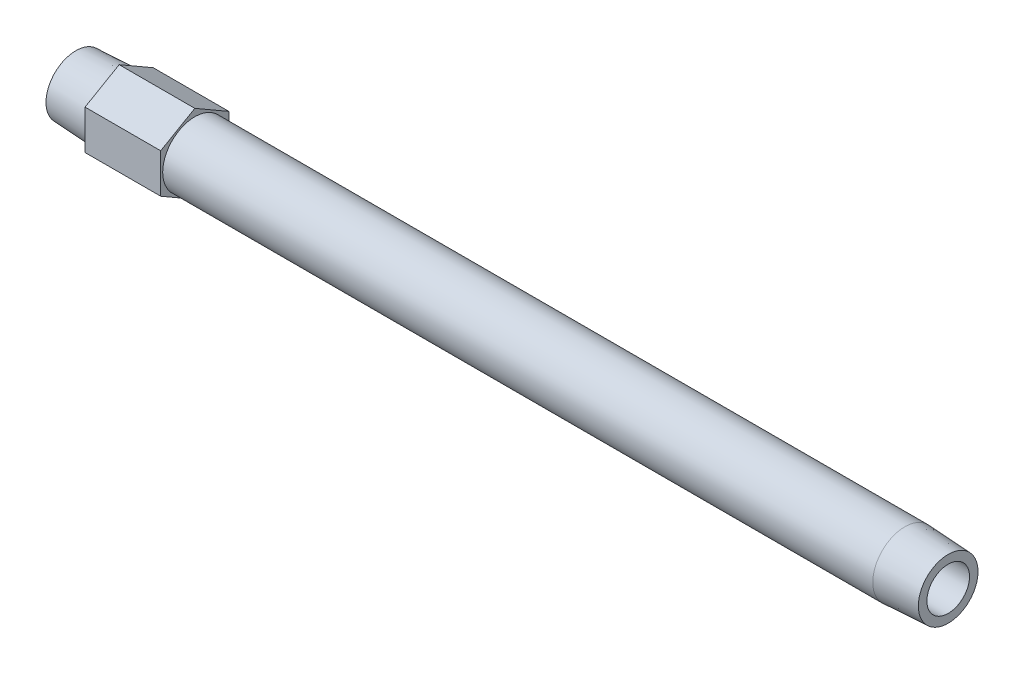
ISO-10303-21;
HEADER;
FILE_DESCRIPTION(('STEP AP214'),'2;1');
FILE_NAME('part.step','',(''),(''),'','','');
FILE_SCHEMA(('AUTOMOTIVE_DESIGN { 1 0 10303 214 1 1 1 1 }'));
ENDSEC;
DATA;
#1=APPLICATION_CONTEXT('core data for automotive mechanical design processes');
#2=APPLICATION_PROTOCOL_DEFINITION('international standard','automotive_design',2000,#1);
#3=PRODUCT_CONTEXT('',#1,'mechanical');
#4=PRODUCT('Part','Part','',(#3));
#5=PRODUCT_RELATED_PRODUCT_CATEGORY('part','',(#4));
#6=PRODUCT_DEFINITION_FORMATION('','',#4);
#7=PRODUCT_DEFINITION_CONTEXT('part definition',#1,'design');
#8=PRODUCT_DEFINITION('design','',#6,#7);
#9=PRODUCT_DEFINITION_SHAPE('','',#8);
#10=(LENGTH_UNIT() NAMED_UNIT(*) SI_UNIT(.MILLI.,.METRE.));
#11=(NAMED_UNIT(*) PLANE_ANGLE_UNIT() SI_UNIT($,.RADIAN.));
#12=(NAMED_UNIT(*) SI_UNIT($,.STERADIAN.) SOLID_ANGLE_UNIT());
#13=UNCERTAINTY_MEASURE_WITH_UNIT(LENGTH_MEASURE(1.E-05),#10,'distance_accuracy_value','');
#14=(GEOMETRIC_REPRESENTATION_CONTEXT(3) GLOBAL_UNCERTAINTY_ASSIGNED_CONTEXT((#13)) GLOBAL_UNIT_ASSIGNED_CONTEXT((#10,
#11,#12)) REPRESENTATION_CONTEXT('',''));
#15=CARTESIAN_POINT('',(0.,0.,0.));
#16=DIRECTION('',(0.,0.,1.));
#17=DIRECTION('',(1.,0.,0.));
#18=AXIS2_PLACEMENT_3D('',#15,#16,#17);
#19=CARTESIAN_POINT('',(0.,0.,-4.78009397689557));
#20=DIRECTION('',(1.,0.,0.));
#21=DIRECTION('',(0.,0.,-1.));
#22=AXIS2_PLACEMENT_3D('',#19,#20,#21);
#23=PLANE('',#22);
#24=CARTESIAN_POINT('',(0.,0.,0.));
#25=DIRECTION('',(-1.,0.,0.));
#26=DIRECTION('',(0.,0.,1.));
#27=AXIS2_PLACEMENT_3D('',#24,#25,#26);
#28=CIRCLE('',#27,4.78009397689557);
#29=CARTESIAN_POINT('',(0.,0.,4.78009397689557));
#30=VERTEX_POINT('',#29);
#31=EDGE_CURVE('E147',#30,#30,#28,.T.);
#32=ORIENTED_EDGE('',*,*,#31,.T.);
#33=EDGE_LOOP('',(#32));
#34=FACE_BOUND('',#33,.T.);
#35=CARTESIAN_POINT('',(0.,0.,0.));
#36=DIRECTION('',(1.,0.,0.));
#37=DIRECTION('',(0.,0.,1.));
#38=AXIS2_PLACEMENT_3D('',#35,#36,#37);
#39=CIRCLE('',#38,3.4163);
#40=CARTESIAN_POINT('',(0.,0.,3.4163));
#41=VERTEX_POINT('',#40);
#42=EDGE_CURVE('E159',#41,#41,#39,.T.);
#43=ORIENTED_EDGE('',*,*,#42,.T.);
#44=EDGE_LOOP('',(#43));
#45=FACE_BOUND('',#44,.T.);
#46=ADVANCED_FACE('F15',(#34,#45),#23,.F.);
#47=CARTESIAN_POINT('',(139.7,0.,-4.78009397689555));
#48=DIRECTION('',(-1.,0.,0.));
#49=DIRECTION('',(0.,0.,1.));
#50=AXIS2_PLACEMENT_3D('',#47,#48,#49);
#51=PLANE('',#50);
#52=CARTESIAN_POINT('',(139.7,0.,0.));
#53=DIRECTION('',(-1.,0.,0.));
#54=DIRECTION('',(0.,0.,1.));
#55=AXIS2_PLACEMENT_3D('',#52,#53,#54);
#56=CIRCLE('',#55,4.78009397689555);
#57=CARTESIAN_POINT('',(139.7,0.,4.78009397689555));
#58=VERTEX_POINT('',#57);
#59=EDGE_CURVE('E150',#58,#58,#56,.T.);
#60=ORIENTED_EDGE('',*,*,#59,.F.);
#61=EDGE_LOOP('',(#60));
#62=FACE_BOUND('',#61,.T.);
#63=CARTESIAN_POINT('',(139.7,0.,0.));
#64=DIRECTION('',(-1.,0.,0.));
#65=DIRECTION('',(0.,0.,1.));
#66=AXIS2_PLACEMENT_3D('',#63,#64,#65);
#67=CIRCLE('',#66,3.4163);
#68=CARTESIAN_POINT('',(139.7,0.,3.4163));
#69=VERTEX_POINT('',#68);
#70=EDGE_CURVE('E156',#69,#69,#67,.F.);
#71=ORIENTED_EDGE('',*,*,#70,.F.);
#72=EDGE_LOOP('',(#71));
#73=FACE_BOUND('',#72,.T.);
#74=ADVANCED_FACE('F178',(#62,#73),#51,.F.);
#75=CARTESIAN_POINT('',(19.05,-9.45872946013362,5.461));
#76=DIRECTION('',(-1.,0.,0.));
#77=DIRECTION('',(0.,-1.,0.));
#78=AXIS2_PLACEMENT_3D('',#75,#76,#77);
#79=PLANE('',#78);
#80=DIRECTION('',(0.,0.5,-0.866025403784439));
#81=VECTOR('',#80,1.);
#82=CARTESIAN_POINT('',(19.05,-6.30581964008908,0.));
#83=LINE('',#82,#81);
#84=CARTESIAN_POINT('',(19.05,-6.30581964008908,0.));
#85=VERTEX_POINT('',#84);
#86=CARTESIAN_POINT('',(19.05,-3.15290982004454,-5.461));
#87=VERTEX_POINT('',#86);
#88=EDGE_CURVE('E103',#85,#87,#83,.T.);
#89=ORIENTED_EDGE('',*,*,#88,.T.);
#90=DIRECTION('',(0.,1.,0.));
#91=VECTOR('',#90,1.);
#92=CARTESIAN_POINT('',(19.05,-3.15290982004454,-5.461));
#93=LINE('',#92,#91);
#94=CARTESIAN_POINT('',(19.05,3.15290982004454,-5.461));
#95=VERTEX_POINT('',#94);
#96=EDGE_CURVE('E83',#87,#95,#93,.T.);
#97=ORIENTED_EDGE('',*,*,#96,.T.);
#98=DIRECTION('',(0.,0.5,0.866025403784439));
#99=VECTOR('',#98,1.);
#100=CARTESIAN_POINT('',(19.05,3.15290982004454,-5.461));
#101=LINE('',#100,#99);
#102=CARTESIAN_POINT('',(19.05,6.30581964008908,0.));
#103=VERTEX_POINT('',#102);
#104=EDGE_CURVE('E102',#95,#103,#101,.T.);
#105=ORIENTED_EDGE('',*,*,#104,.T.);
#106=DIRECTION('',(0.,-0.5,0.866025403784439));
#107=VECTOR('',#106,1.);
#108=CARTESIAN_POINT('',(19.05,6.30581964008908,0.));
#109=LINE('',#108,#107);
#110=CARTESIAN_POINT('',(19.05,3.15290982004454,5.461));
#111=VERTEX_POINT('',#110);
#112=EDGE_CURVE('E105',#103,#111,#109,.T.);
#113=ORIENTED_EDGE('',*,*,#112,.T.);
#114=DIRECTION('',(0.,-1.,0.));
#115=VECTOR('',#114,1.);
#116=CARTESIAN_POINT('',(19.05,3.15290982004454,5.461));
#117=LINE('',#116,#115);
#118=CARTESIAN_POINT('',(19.05,-3.15290982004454,5.461));
#119=VERTEX_POINT('',#118);
#120=EDGE_CURVE('E35',#111,#119,#117,.T.);
#121=ORIENTED_EDGE('',*,*,#120,.T.);
#122=DIRECTION('',(0.,-0.5,-0.866025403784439));
#123=VECTOR('',#122,1.);
#124=CARTESIAN_POINT('',(19.05,-3.15290982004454,5.461));
#125=LINE('',#124,#123);
#126=EDGE_CURVE('E30',#119,#85,#125,.T.);
#127=ORIENTED_EDGE('',*,*,#126,.T.);
#128=EDGE_LOOP('',(#89,#97,#105,#113,#121,#127));
#129=FACE_BOUND('',#128,.T.);
#130=CARTESIAN_POINT('',(19.05,0.,0.));
#131=DIRECTION('',(-1.,0.,0.));
#132=DIRECTION('',(0.,-1.,0.));
#133=AXIS2_PLACEMENT_3D('',#130,#131,#132);
#134=CIRCLE('',#133,5.1435);
#135=CARTESIAN_POINT('',(19.05,-5.1435,0.));
#136=VERTEX_POINT('',#135);
#137=EDGE_CURVE('E89',#136,#136,#134,.F.);
#138=ORIENTED_EDGE('',*,*,#137,.F.);
#139=EDGE_LOOP('',(#138));
#140=FACE_BOUND('',#139,.T.);
#141=ADVANCED_FACE('F124',(#129,#140),#79,.F.);
#142=CARTESIAN_POINT('',(6.9342,-9.45872946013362,5.461));
#143=DIRECTION('',(-1.,0.,0.));
#144=DIRECTION('',(0.,-1.,0.));
#145=AXIS2_PLACEMENT_3D('',#142,#143,#144);
#146=PLANE('',#145);
#147=DIRECTION('',(0.,0.5,-0.866025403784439));
#148=VECTOR('',#147,1.);
#149=CARTESIAN_POINT('',(6.9342,-6.30581964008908,0.));
#150=LINE('',#149,#148);
#151=CARTESIAN_POINT('',(6.9342,-6.30581964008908,0.));
#152=VERTEX_POINT('',#151);
#153=CARTESIAN_POINT('',(6.9342,-3.15290982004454,-5.461));
#154=VERTEX_POINT('',#153);
#155=EDGE_CURVE('E73',#152,#154,#150,.T.);
#156=ORIENTED_EDGE('',*,*,#155,.F.);
#157=DIRECTION('',(0.,-0.5,-0.866025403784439));
#158=VECTOR('',#157,1.);
#159=CARTESIAN_POINT('',(6.9342,-3.15290982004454,5.461));
#160=LINE('',#159,#158);
#161=CARTESIAN_POINT('',(6.9342,-3.15290982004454,5.461));
#162=VERTEX_POINT('',#161);
#163=EDGE_CURVE('E99',#162,#152,#160,.T.);
#164=ORIENTED_EDGE('',*,*,#163,.F.);
#165=DIRECTION('',(0.,-1.,0.));
#166=VECTOR('',#165,1.);
#167=CARTESIAN_POINT('',(6.9342,3.15290982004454,5.461));
#168=LINE('',#167,#166);
#169=CARTESIAN_POINT('',(6.9342,3.15290982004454,5.461));
#170=VERTEX_POINT('',#169);
#171=EDGE_CURVE('E133',#170,#162,#168,.T.);
#172=ORIENTED_EDGE('',*,*,#171,.F.);
#173=DIRECTION('',(0.,-0.5,0.866025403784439));
#174=VECTOR('',#173,1.);
#175=CARTESIAN_POINT('',(6.9342,6.30581964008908,0.));
#176=LINE('',#175,#174);
#177=CARTESIAN_POINT('',(6.9342,6.30581964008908,0.));
#178=VERTEX_POINT('',#177);
#179=EDGE_CURVE('E129',#178,#170,#176,.T.);
#180=ORIENTED_EDGE('',*,*,#179,.F.);
#181=DIRECTION('',(0.,0.5,0.866025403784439));
#182=VECTOR('',#181,1.);
#183=CARTESIAN_POINT('',(6.9342,3.15290982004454,-5.461));
#184=LINE('',#183,#182);
#185=CARTESIAN_POINT('',(6.9342,3.15290982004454,-5.461));
#186=VERTEX_POINT('',#185);
#187=EDGE_CURVE('E75',#186,#178,#184,.T.);
#188=ORIENTED_EDGE('',*,*,#187,.F.);
#189=DIRECTION('',(0.,1.,0.));
#190=VECTOR('',#189,1.);
#191=CARTESIAN_POINT('',(6.9342,-3.15290982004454,-5.461));
#192=LINE('',#191,#190);
#193=EDGE_CURVE('E68',#154,#186,#192,.T.);
#194=ORIENTED_EDGE('',*,*,#193,.F.);
#195=EDGE_LOOP('',(#156,#164,#172,#180,#188,#194));
#196=FACE_BOUND('',#195,.T.);
#197=CARTESIAN_POINT('',(6.9342,0.,0.));
#198=DIRECTION('',(-1.,0.,0.));
#199=DIRECTION('',(0.,0.,1.));
#200=AXIS2_PLACEMENT_3D('',#197,#198,#199);
#201=CIRCLE('',#200,5.1435);
#202=CARTESIAN_POINT('',(6.9342,0.,5.1435));
#203=VERTEX_POINT('',#202);
#204=EDGE_CURVE('E95',#203,#203,#201,.T.);
#205=ORIENTED_EDGE('',*,*,#204,.F.);
#206=EDGE_LOOP('',(#205));
#207=FACE_BOUND('',#206,.T.);
#208=ADVANCED_FACE('F69',(#196,#207),#146,.T.);
#209=CARTESIAN_POINT('',(19.05,-6.30581964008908,0.));
#210=DIRECTION('',(0.,0.866025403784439,0.5));
#211=DIRECTION('',(0.,-0.5,0.866025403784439));
#212=AXIS2_PLACEMENT_3D('',#209,#210,#211);
#213=PLANE('',#212);
#214=ORIENTED_EDGE('',*,*,#155,.T.);
#215=DIRECTION('',(-1.,0.,0.));
#216=VECTOR('',#215,1.);
#217=CARTESIAN_POINT('',(19.05,-3.15290982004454,-5.461));
#218=LINE('',#217,#216);
#219=EDGE_CURVE('E10',#87,#154,#218,.T.);
#220=ORIENTED_EDGE('',*,*,#219,.F.);
#221=ORIENTED_EDGE('',*,*,#88,.F.);
#222=DIRECTION('',(-1.,0.,0.));
#223=VECTOR('',#222,1.);
#224=CARTESIAN_POINT('',(19.05,-6.30581964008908,0.));
#225=LINE('',#224,#223);
#226=EDGE_CURVE('E87',#85,#152,#225,.T.);
#227=ORIENTED_EDGE('',*,*,#226,.T.);
#228=EDGE_LOOP('',(#214,#220,#221,#227));
#229=FACE_BOUND('',#228,.T.);
#230=ADVANCED_FACE('F17',(#229),#213,.F.);
#231=CARTESIAN_POINT('',(19.05,-3.15290982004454,-5.461));
#232=DIRECTION('',(0.,0.,1.));
#233=DIRECTION('',(0.,-1.,0.));
#234=AXIS2_PLACEMENT_3D('',#231,#232,#233);
#235=PLANE('',#234);
#236=ORIENTED_EDGE('',*,*,#193,.T.);
#237=DIRECTION('',(-1.,0.,0.));
#238=VECTOR('',#237,1.);
#239=CARTESIAN_POINT('',(19.05,3.15290982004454,-5.461));
#240=LINE('',#239,#238);
#241=EDGE_CURVE('E23',#95,#186,#240,.T.);
#242=ORIENTED_EDGE('',*,*,#241,.F.);
#243=ORIENTED_EDGE('',*,*,#96,.F.);
#244=ORIENTED_EDGE('',*,*,#219,.T.);
#245=EDGE_LOOP('',(#236,#242,#243,#244));
#246=FACE_BOUND('',#245,.T.);
#247=ADVANCED_FACE('F82',(#246),#235,.F.);
#248=CARTESIAN_POINT('',(19.05,3.15290982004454,-5.461));
#249=DIRECTION('',(0.,-0.866025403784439,0.5));
#250=DIRECTION('',(0.,-0.5,-0.866025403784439));
#251=AXIS2_PLACEMENT_3D('',#248,#249,#250);
#252=PLANE('',#251);
#253=ORIENTED_EDGE('',*,*,#187,.T.);
#254=DIRECTION('',(-1.,0.,0.));
#255=VECTOR('',#254,1.);
#256=CARTESIAN_POINT('',(19.05,6.30581964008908,0.));
#257=LINE('',#256,#255);
#258=EDGE_CURVE('E117',#103,#178,#257,.T.);
#259=ORIENTED_EDGE('',*,*,#258,.F.);
#260=ORIENTED_EDGE('',*,*,#104,.F.);
#261=ORIENTED_EDGE('',*,*,#241,.T.);
#262=EDGE_LOOP('',(#253,#259,#260,#261));
#263=FACE_BOUND('',#262,.T.);
#264=ADVANCED_FACE('F121',(#263),#252,.F.);
#265=CARTESIAN_POINT('',(19.05,6.30581964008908,0.));
#266=DIRECTION('',(0.,-0.866025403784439,-0.5));
#267=DIRECTION('',(0.,0.5,-0.866025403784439));
#268=AXIS2_PLACEMENT_3D('',#265,#266,#267);
#269=PLANE('',#268);
#270=ORIENTED_EDGE('',*,*,#179,.T.);
#271=DIRECTION('',(-1.,0.,0.));
#272=VECTOR('',#271,1.);
#273=CARTESIAN_POINT('',(19.05,3.15290982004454,5.461));
#274=LINE('',#273,#272);
#275=EDGE_CURVE('E114',#111,#170,#274,.T.);
#276=ORIENTED_EDGE('',*,*,#275,.F.);
#277=ORIENTED_EDGE('',*,*,#112,.F.);
#278=ORIENTED_EDGE('',*,*,#258,.T.);
#279=EDGE_LOOP('',(#270,#276,#277,#278));
#280=FACE_BOUND('',#279,.T.);
#281=ADVANCED_FACE('F128',(#280),#269,.F.);
#282=CARTESIAN_POINT('',(19.05,3.15290982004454,5.461));
#283=DIRECTION('',(0.,0.,-1.));
#284=DIRECTION('',(-1.,0.,0.));
#285=AXIS2_PLACEMENT_3D('',#282,#283,#284);
#286=PLANE('',#285);
#287=ORIENTED_EDGE('',*,*,#171,.T.);
#288=DIRECTION('',(-1.,0.,0.));
#289=VECTOR('',#288,1.);
#290=CARTESIAN_POINT('',(19.05,-3.15290982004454,5.461));
#291=LINE('',#290,#289);
#292=EDGE_CURVE('E111',#119,#162,#291,.T.);
#293=ORIENTED_EDGE('',*,*,#292,.F.);
#294=ORIENTED_EDGE('',*,*,#120,.F.);
#295=ORIENTED_EDGE('',*,*,#275,.T.);
#296=EDGE_LOOP('',(#287,#293,#294,#295));
#297=FACE_BOUND('',#296,.T.);
#298=ADVANCED_FACE('F132',(#297),#286,.F.);
#299=CARTESIAN_POINT('',(19.05,-3.15290982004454,5.461));
#300=DIRECTION('',(0.,0.866025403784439,-0.5));
#301=DIRECTION('',(0.,0.5,0.866025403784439));
#302=AXIS2_PLACEMENT_3D('',#299,#300,#301);
#303=PLANE('',#302);
#304=ORIENTED_EDGE('',*,*,#163,.T.);
#305=ORIENTED_EDGE('',*,*,#226,.F.);
#306=ORIENTED_EDGE('',*,*,#126,.F.);
#307=ORIENTED_EDGE('',*,*,#292,.T.);
#308=EDGE_LOOP('',(#304,#305,#306,#307));
#309=FACE_BOUND('',#308,.T.);
#310=ADVANCED_FACE('F135',(#309),#303,.F.);
#311=CARTESIAN_POINT('',(6.9342,0.,0.));
#312=DIRECTION('',(1.,0.,0.));
#313=DIRECTION('',(0.,0.,-1.));
#314=AXIS2_PLACEMENT_3D('',#311,#312,#313);
#315=CONICAL_SURFACE('',#314,5.1435,0.0523598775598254);
#316=ORIENTED_EDGE('',*,*,#31,.F.);
#317=EDGE_LOOP('',(#316));
#318=FACE_BOUND('',#317,.T.);
#319=ORIENTED_EDGE('',*,*,#204,.T.);
#320=EDGE_LOOP('',(#319));
#321=FACE_BOUND('',#320,.T.);
#322=ADVANCED_FACE('F187',(#318,#321),#315,.T.);
#323=CARTESIAN_POINT('',(-60.,0.,0.));
#324=DIRECTION('',(-1.,0.,0.));
#325=DIRECTION('',(0.,0.,1.));
#326=AXIS2_PLACEMENT_3D('',#323,#324,#325);
#327=CYLINDRICAL_SURFACE('',#326,5.1435);
#328=ORIENTED_EDGE('',*,*,#137,.T.);
#329=EDGE_LOOP('',(#328));
#330=FACE_BOUND('',#329,.T.);
#331=CARTESIAN_POINT('',(132.7658,0.,0.));
#332=DIRECTION('',(-1.,0.,0.));
#333=DIRECTION('',(0.,0.,1.));
#334=AXIS2_PLACEMENT_3D('',#331,#332,#333);
#335=CIRCLE('',#334,5.1435);
#336=CARTESIAN_POINT('',(132.7658,0.,5.1435));
#337=VERTEX_POINT('',#336);
#338=EDGE_CURVE('E153',#337,#337,#335,.T.);
#339=ORIENTED_EDGE('',*,*,#338,.T.);
#340=EDGE_LOOP('',(#339));
#341=FACE_BOUND('',#340,.T.);
#342=ADVANCED_FACE('F174',(#330,#341),#327,.T.);
#343=CARTESIAN_POINT('',(139.7,0.,0.));
#344=DIRECTION('',(-1.,0.,0.));
#345=DIRECTION('',(0.,0.,1.));
#346=AXIS2_PLACEMENT_3D('',#343,#344,#345);
#347=CONICAL_SURFACE('',#346,4.78009397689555,0.0523598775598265);
#348=ORIENTED_EDGE('',*,*,#338,.F.);
#349=EDGE_LOOP('',(#348));
#350=FACE_BOUND('',#349,.T.);
#351=ORIENTED_EDGE('',*,*,#59,.T.);
#352=EDGE_LOOP('',(#351));
#353=FACE_BOUND('',#352,.T.);
#354=ADVANCED_FACE('F167',(#350,#353),#347,.T.);
#355=CARTESIAN_POINT('',(140.692691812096,0.,0.));
#356=DIRECTION('',(-1.,0.,0.));
#357=DIRECTION('',(0.,0.,1.));
#358=AXIS2_PLACEMENT_3D('',#355,#356,#357);
#359=CYLINDRICAL_SURFACE('',#358,3.4163);
#360=ORIENTED_EDGE('',*,*,#70,.T.);
#361=EDGE_LOOP('',(#360));
#362=FACE_BOUND('',#361,.T.);
#363=ORIENTED_EDGE('',*,*,#42,.F.);
#364=EDGE_LOOP('',(#363));
#365=FACE_BOUND('',#364,.T.);
#366=ADVANCED_FACE('F165',(#362,#365),#359,.F.);
#367=CLOSED_SHELL('',(#46,#74,#141,#208,#230,#247,#264,#281,#298,#310,#322,#342,#354,#366));
#368=MANIFOLD_SOLID_BREP('B1',#367);
#369=ADVANCED_BREP_SHAPE_REPRESENTATION('',(#18,#368),#14);
#370=SHAPE_DEFINITION_REPRESENTATION(#9,#369);
ENDSEC;
END-ISO-10303-21;
